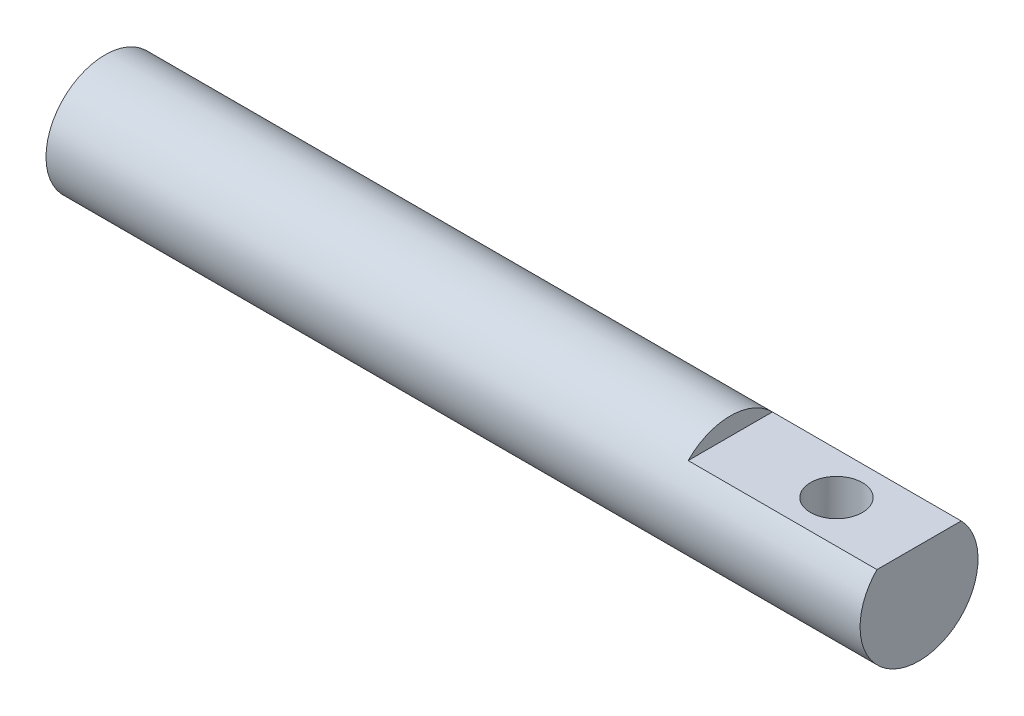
ISO-10303-21;
HEADER;
FILE_DESCRIPTION(('STEP AP214'),'2;1');
FILE_NAME('part.step','',(''),(''),'','','');
FILE_SCHEMA(('AUTOMOTIVE_DESIGN { 1 0 10303 214 1 1 1 1 }'));
ENDSEC;
DATA;
#1=APPLICATION_CONTEXT('core data for automotive mechanical design processes');
#2=APPLICATION_PROTOCOL_DEFINITION('international standard','automotive_design',2000,#1);
#3=PRODUCT_CONTEXT('',#1,'mechanical');
#4=PRODUCT('Part','Part','',(#3));
#5=PRODUCT_RELATED_PRODUCT_CATEGORY('part','',(#4));
#6=PRODUCT_DEFINITION_FORMATION('','',#4);
#7=PRODUCT_DEFINITION_CONTEXT('part definition',#1,'design');
#8=PRODUCT_DEFINITION('design','',#6,#7);
#9=PRODUCT_DEFINITION_SHAPE('','',#8);
#10=(LENGTH_UNIT() NAMED_UNIT(*) SI_UNIT(.MILLI.,.METRE.));
#11=(NAMED_UNIT(*) PLANE_ANGLE_UNIT() SI_UNIT($,.RADIAN.));
#12=(NAMED_UNIT(*) SI_UNIT($,.STERADIAN.) SOLID_ANGLE_UNIT());
#13=UNCERTAINTY_MEASURE_WITH_UNIT(LENGTH_MEASURE(1.E-05),#10,'distance_accuracy_value','');
#14=(GEOMETRIC_REPRESENTATION_CONTEXT(3) GLOBAL_UNCERTAINTY_ASSIGNED_CONTEXT((#13)) GLOBAL_UNIT_ASSIGNED_CONTEXT((#10,
#11,#12)) REPRESENTATION_CONTEXT('',''));
#15=CARTESIAN_POINT('',(0.,0.,0.));
#16=DIRECTION('',(0.,0.,1.));
#17=DIRECTION('',(1.,0.,0.));
#18=AXIS2_PLACEMENT_3D('',#15,#16,#17);
#19=CARTESIAN_POINT('',(-90.4663961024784,0.,0.));
#20=DIRECTION('',(-1.,0.,0.));
#21=DIRECTION('',(0.,0.,1.));
#22=AXIS2_PLACEMENT_3D('',#19,#20,#21);
#23=CYLINDRICAL_SURFACE('',#22,10.);
#24=CARTESIAN_POINT('',(50.6,-10.,0.));
#25=CARTESIAN_POINT('',(50.6000008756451,-9.99999927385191,0.117311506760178));
#26=CARTESIAN_POINT('',(50.6046977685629,-9.99793022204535,0.234654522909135));
#27=CARTESIAN_POINT('',(50.6234394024,-9.98970539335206,0.468497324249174));
#28=CARTESIAN_POINT('',(50.637489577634,-9.98354724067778,0.584996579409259));
#29=CARTESIAN_POINT('',(50.6748222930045,-9.96729046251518,0.81645802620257));
#30=CARTESIAN_POINT('',(50.6981223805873,-9.95718434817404,0.931416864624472));
#31=CARTESIAN_POINT('',(50.7537179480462,-9.93329160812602,1.15879035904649));
#32=CARTESIAN_POINT('',(50.7860171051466,-9.91950347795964,1.27120395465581));
#33=CARTESIAN_POINT('',(50.8591464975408,-9.88865875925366,1.49225565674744));
#34=CARTESIAN_POINT('',(50.8999422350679,-9.87161541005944,1.60090701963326));
#35=CARTESIAN_POINT('',(50.9897759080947,-9.83464430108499,1.8142545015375));
#36=CARTESIAN_POINT('',(51.0388169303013,-9.81471546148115,1.91894912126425));
#37=CARTESIAN_POINT('',(51.1976622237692,-9.75132267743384,2.22603764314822));
#38=CARTESIAN_POINT('',(51.3192827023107,-9.70421135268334,2.42171774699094));
#39=CARTESIAN_POINT('',(51.5974009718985,-9.60209161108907,2.80004131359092));
#40=CARTESIAN_POINT('',(51.7553387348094,-9.54680609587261,2.98154351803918));
#41=CARTESIAN_POINT('',(52.098552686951,-9.43567663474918,3.31649978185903));
#42=CARTESIAN_POINT('',(52.2838447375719,-9.37983238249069,3.46993745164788));
#43=CARTESIAN_POINT('',(52.6893089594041,-9.2703443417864,3.75301100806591));
#44=CARTESIAN_POINT('',(52.9108577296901,-9.21700154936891,3.88082001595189));
#45=CARTESIAN_POINT('',(53.2586528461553,-9.14654704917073,4.0427880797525));
#46=CARTESIAN_POINT('',(53.377210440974,-9.12464909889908,4.09183262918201));
#47=CARTESIAN_POINT('',(53.6187263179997,-9.08480986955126,4.17953993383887));
#48=CARTESIAN_POINT('',(53.7416822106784,-9.06686647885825,4.21820823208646));
#49=CARTESIAN_POINT('',(53.9846428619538,-9.03643592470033,4.2829943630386));
#50=CARTESIAN_POINT('',(54.1044739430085,-9.02371552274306,4.3096555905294));
#51=CARTESIAN_POINT('',(54.3462898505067,-9.00293510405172,4.35289987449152));
#52=CARTESIAN_POINT('',(54.4682736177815,-8.99487285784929,4.36948775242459));
#53=CARTESIAN_POINT('',(54.7133888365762,-8.98371652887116,4.39237983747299));
#54=CARTESIAN_POINT('',(54.8365198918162,-8.98062079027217,4.39868747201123));
#55=CARTESIAN_POINT('',(55.0828942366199,-8.97951545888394,4.40094353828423));
#56=CARTESIAN_POINT('',(55.2061375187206,-8.98150554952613,4.39689261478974));
#57=CARTESIAN_POINT('',(55.4408972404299,-8.99009811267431,4.37929465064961));
#58=CARTESIAN_POINT('',(55.5524945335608,-8.99628092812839,4.36661125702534));
#59=CARTESIAN_POINT('',(55.7741233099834,-9.01260340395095,4.33281890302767));
#60=CARTESIAN_POINT('',(55.8841542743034,-9.02274434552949,4.31170721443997));
#61=CARTESIAN_POINT('',(56.210732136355,-9.05865643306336,4.23603022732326));
#62=CARTESIAN_POINT('',(56.4239507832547,-9.08992447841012,4.16910861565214));
#63=CARTESIAN_POINT('',(56.840639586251,-9.16432218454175,4.0029461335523));
#64=CARTESIAN_POINT('',(57.0437865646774,-9.20770067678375,3.90301819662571));
#65=CARTESIAN_POINT('',(57.4313077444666,-9.30139084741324,3.67415350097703));
#66=CARTESIAN_POINT('',(57.6156740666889,-9.35170541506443,3.54520463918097));
#67=CARTESIAN_POINT('',(57.9788507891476,-9.45942031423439,3.24756701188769));
#68=CARTESIAN_POINT('',(58.155458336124,-9.51703902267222,3.07626255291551));
#69=CARTESIAN_POINT('',(58.4782288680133,-9.62886931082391,2.70596833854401));
#70=CARTESIAN_POINT('',(58.6243830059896,-9.68307989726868,2.50697056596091));
#71=CARTESIAN_POINT('',(58.8858452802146,-9.78390538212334,2.0795878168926));
#72=CARTESIAN_POINT('',(59.00015854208,-9.83026057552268,1.85052830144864));
#73=CARTESIAN_POINT('',(59.1878374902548,-9.90811015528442,1.37386638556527));
#74=CARTESIAN_POINT('',(59.2612284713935,-9.93961371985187,1.12627554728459));
#75=CARTESIAN_POINT('',(59.3601414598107,-9.98243454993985,0.637893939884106));
#76=CARTESIAN_POINT('',(59.3886124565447,-9.99499276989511,0.397809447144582));
#77=CARTESIAN_POINT('',(59.4057912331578,-10.0025454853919,-0.0840200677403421));
#78=CARTESIAN_POINT('',(59.3945121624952,-9.99754578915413,-0.325764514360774));
#79=CARTESIAN_POINT('',(59.3345302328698,-9.97133433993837,-0.789582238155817));
#80=CARTESIAN_POINT('',(59.287985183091,-9.95105771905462,-1.01199376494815));
#81=CARTESIAN_POINT('',(59.1618938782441,-9.89737940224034,-1.44555457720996));
#82=CARTESIAN_POINT('',(59.0823435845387,-9.86397610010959,-1.65670248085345));
#83=CARTESIAN_POINT('',(58.8899534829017,-9.78589702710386,-2.06922424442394));
#84=CARTESIAN_POINT('',(58.7761514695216,-9.74090174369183,-2.27008679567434));
#85=CARTESIAN_POINT('',(58.5195261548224,-9.64432232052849,-2.65059283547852));
#86=CARTESIAN_POINT('',(58.3766902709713,-9.59273532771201,-2.83022707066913));
#87=CARTESIAN_POINT('',(58.052918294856,-9.48342069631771,-3.17813921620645));
#88=CARTESIAN_POINT('',(57.8698615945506,-9.42553017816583,-3.34439341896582));
#89=CARTESIAN_POINT('',(57.4775515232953,-9.31359539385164,-3.64453875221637));
#90=CARTESIAN_POINT('',(57.2682894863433,-9.25955240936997,-3.77841913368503));
#91=CARTESIAN_POINT('',(56.9360956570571,-9.18566329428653,-3.95319006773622));
#92=CARTESIAN_POINT('',(56.8209206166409,-9.1620072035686,-4.00756040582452));
#93=CARTESIAN_POINT('',(56.5857379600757,-9.11818214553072,-4.10629671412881));
#94=CARTESIAN_POINT('',(56.4657325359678,-9.09801161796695,-4.15066716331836));
#95=CARTESIAN_POINT('',(56.2218000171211,-9.06191214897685,-4.22890136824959));
#96=CARTESIAN_POINT('',(56.0978751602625,-9.04598083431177,-4.26277100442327));
#97=CARTESIAN_POINT('',(55.8470318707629,-9.01897594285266,-4.31961424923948));
#98=CARTESIAN_POINT('',(55.7201137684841,-9.00790183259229,-4.34258905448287));
#99=CARTESIAN_POINT('',(55.4751262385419,-8.9917783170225,-4.37586938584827));
#100=CARTESIAN_POINT('',(55.3572064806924,-8.98630183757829,-4.38707519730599));
#101=CARTESIAN_POINT('',(55.1206788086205,-8.98001037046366,-4.39993940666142));
#102=CARTESIAN_POINT('',(55.0020706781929,-8.97919693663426,-4.4015946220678));
#103=CARTESIAN_POINT('',(54.7652381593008,-8.98226584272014,-4.39532840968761));
#104=CARTESIAN_POINT('',(54.647013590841,-8.98614551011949,-4.38741243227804));
#105=CARTESIAN_POINT('',(54.4117796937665,-8.99845540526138,-4.36210926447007));
#106=CARTESIAN_POINT('',(54.2947708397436,-9.00688734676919,-4.34471850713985));
#107=CARTESIAN_POINT('',(54.0696681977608,-9.02738597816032,-4.30195645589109));
#108=CARTESIAN_POINT('',(53.9614524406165,-9.03921202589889,-4.27710970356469));
#109=CARTESIAN_POINT('',(53.7475872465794,-9.06627054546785,-4.21944847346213));
#110=CARTESIAN_POINT('',(53.6419386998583,-9.08150418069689,-4.18663127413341));
#111=CARTESIAN_POINT('',(53.3298173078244,-9.13167379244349,-4.07665014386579));
#112=CARTESIAN_POINT('',(53.1280136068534,-9.17109357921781,-3.98792681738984));
#113=CARTESIAN_POINT('',(52.7289793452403,-9.26051910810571,-3.77581548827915));
#114=CARTESIAN_POINT('',(52.5328538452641,-9.31103828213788,-3.65058330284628));
#115=CARTESIAN_POINT('',(52.1632677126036,-9.41571067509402,-3.37144443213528));
#116=CARTESIAN_POINT('',(51.9898163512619,-9.46986536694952,-3.21752607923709));
#117=CARTESIAN_POINT('',(51.6552293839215,-9.58125720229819,-2.86974961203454));
#118=CARTESIAN_POINT('',(51.4963947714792,-9.63836494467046,-2.67360835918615));
#119=CARTESIAN_POINT('',(51.284481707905,-9.7180661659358,-2.36027605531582));
#120=CARTESIAN_POINT('',(51.2181903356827,-9.7436583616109,-2.2525490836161));
#121=CARTESIAN_POINT('',(51.0949179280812,-9.79216270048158,-2.03133880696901));
#122=CARTESIAN_POINT('',(51.0379325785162,-9.81507608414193,-1.91785820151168));
#123=CARTESIAN_POINT('',(50.9344110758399,-9.85732250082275,-1.68724036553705));
#124=CARTESIAN_POINT('',(50.8877598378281,-9.87669449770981,-1.57016188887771));
#125=CARTESIAN_POINT('',(50.8045554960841,-9.91162590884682,-1.33197103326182));
#126=CARTESIAN_POINT('',(50.7679975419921,-9.92718715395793,-1.21086062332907));
#127=CARTESIAN_POINT('',(50.7054454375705,-9.95401438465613,-0.965794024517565));
#128=CARTESIAN_POINT('',(50.6794258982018,-9.96529068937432,-0.841845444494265));
#129=CARTESIAN_POINT('',(50.6381569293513,-9.98325231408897,-0.591902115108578));
#130=CARTESIAN_POINT('',(50.6228999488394,-9.98994085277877,-0.465908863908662));
#131=CARTESIAN_POINT('',(50.6087453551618,-9.99615456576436,-0.283006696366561));
#132=CARTESIAN_POINT('',(50.6054670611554,-9.99759551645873,-0.226467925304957));
#133=CARTESIAN_POINT('',(50.6010941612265,-9.99951841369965,-0.113288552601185));
#134=CARTESIAN_POINT('',(50.5999995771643,-10.0000003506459,-0.0566479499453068));
#135=CARTESIAN_POINT('',(50.6,-10.,0.));
#136=B_SPLINE_CURVE_WITH_KNOTS('',3,(#24,#25,#26,#27,#28,#29,#30,#31,#32,#33,#34,#35,#36,#37,
#38,#39,#40,#41,#42,#43,#44,#45,#46,#47,#48,#49,#50,#51,#52,#53,#54,#55,#56,#57,#58,#59,#60,#61,
#62,#63,#64,#65,#66,#67,#68,#69,#70,#71,#72,#73,#74,#75,#76,#77,#78,#79,#80,#81,#82,#83,#84,#85,
#86,#87,#88,#89,#90,#91,#92,#93,#94,#95,#96,#97,#98,#99,#100,#101,#102,#103,#104,#105,#106,#107,
#108,#109,#110,#111,#112,#113,#114,#115,#116,#117,#118,#119,#120,#121,#122,#123,#124,#125,#126,
#127,#128,#129,#130,#131,#132,#133,#134,#135),.UNSPECIFIED.,.T.,.F.,(4,2,2,2,2,2,2,2,2,2,2,2,2,
2,2,2,2,2,2,2,2,2,2,2,2,2,2,2,2,2,2,2,2,2,2,2,2,2,2,2,2,2,2,2,2,2,2,2,2,2,2,2,2,2,2,4),(0.,
0.351877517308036,0.703959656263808,1.05671292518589,1.40961054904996,1.76110233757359,
2.11272600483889,2.81508489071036,3.55256658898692,4.29047760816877,5.06994179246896,
5.45996567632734,5.84978079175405,6.21953845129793,6.58911899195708,6.95857628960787,
7.32801059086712,7.66505706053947,8.00221271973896,8.67596853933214,9.36474053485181,
10.0538003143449,10.8085095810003,11.5634377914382,12.3398245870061,13.1157309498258,
13.8381934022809,14.5604168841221,15.2416973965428,15.9230612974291,16.6257080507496,
17.3286599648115,18.0872416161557,18.8460747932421,19.2342667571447,19.6222845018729,
20.0100845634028,20.3978420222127,20.7531080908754,21.1084925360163,21.4636747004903,
21.8189906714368,22.1535857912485,22.4882953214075,23.1572438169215,23.8686914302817,
24.5804290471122,25.3526808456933,25.7394411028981,26.1260215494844,26.5080522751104,
26.8898990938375,27.270820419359,27.6514742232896,27.8213888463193,27.9913051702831),.UNSPECIFIED.);
#137=CARTESIAN_POINT('',(50.6,-10.,0.));
#138=VERTEX_POINT('',#137);
#139=EDGE_CURVE('E156',#138,#138,#136,.T.);
#140=ORIENTED_EDGE('',*,*,#139,.T.);
#141=EDGE_LOOP('',(#140));
#142=FACE_BOUND('',#141,.T.);
#143=CARTESIAN_POINT('',(69.,0.,0.));
#144=DIRECTION('',(-1.,0.,0.));
#145=DIRECTION('',(0.,0.,1.));
#146=AXIS2_PLACEMENT_3D('',#143,#144,#145);
#147=CIRCLE('',#146,10.);
#148=CARTESIAN_POINT('',(69.,7.,-7.14142842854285));
#149=VERTEX_POINT('',#148);
#150=CARTESIAN_POINT('',(69.,7.,7.14142842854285));
#151=VERTEX_POINT('',#150);
#152=EDGE_CURVE('E141',#149,#151,#147,.T.);
#153=ORIENTED_EDGE('',*,*,#152,.T.);
#154=DIRECTION('',(1.,0.,0.));
#155=VECTOR('',#154,1.);
#156=CARTESIAN_POINT('',(37.,7.,7.14142842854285));
#157=LINE('',#156,#155);
#158=CARTESIAN_POINT('',(37.,7.,7.14142842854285));
#159=VERTEX_POINT('',#158);
#160=EDGE_CURVE('E132',#159,#151,#157,.T.);
#161=ORIENTED_EDGE('',*,*,#160,.F.);
#162=CARTESIAN_POINT('',(37.,0.,0.));
#163=DIRECTION('',(1.,0.,0.));
#164=DIRECTION('',(0.,0.,1.));
#165=AXIS2_PLACEMENT_3D('',#162,#163,#164);
#166=CIRCLE('',#165,10.);
#167=CARTESIAN_POINT('',(37.,7.,-7.14142842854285));
#168=VERTEX_POINT('',#167);
#169=EDGE_CURVE('E129',#168,#159,#166,.T.);
#170=ORIENTED_EDGE('',*,*,#169,.F.);
#171=DIRECTION('',(1.,0.,0.));
#172=VECTOR('',#171,1.);
#173=CARTESIAN_POINT('',(37.,7.,-7.14142842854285));
#174=LINE('',#173,#172);
#175=EDGE_CURVE('E134',#168,#149,#174,.T.);
#176=ORIENTED_EDGE('',*,*,#175,.T.);
#177=EDGE_LOOP('',(#153,#161,#170,#176));
#178=FACE_BOUND('',#177,.T.);
#179=CARTESIAN_POINT('',(-69.,0.,0.));
#180=DIRECTION('',(-1.,0.,0.));
#181=DIRECTION('',(0.,0.,1.));
#182=AXIS2_PLACEMENT_3D('',#179,#180,#181);
#183=CIRCLE('',#182,10.);
#184=CARTESIAN_POINT('',(-69.,0.,10.));
#185=VERTEX_POINT('',#184);
#186=EDGE_CURVE('E137',#185,#185,#183,.T.);
#187=ORIENTED_EDGE('',*,*,#186,.F.);
#188=EDGE_LOOP('',(#187));
#189=FACE_BOUND('',#188,.T.);
#190=CARTESIAN_POINT('',(4.,-9.16515138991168,-4.));
#191=CARTESIAN_POINT('',(4.10761170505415,-9.16512928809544,-4.00001596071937));
#192=CARTESIAN_POINT('',(4.2152113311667,-9.16704612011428,-3.99565782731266));
#193=CARTESIAN_POINT('',(4.42954259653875,-9.17459250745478,-3.9783181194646));
#194=CARTESIAN_POINT('',(4.5362745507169,-9.18022064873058,-3.96533982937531));
#195=CARTESIAN_POINT('',(4.74769364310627,-9.19499565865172,-3.93095207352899));
#196=CARTESIAN_POINT('',(4.85238716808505,-9.20412861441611,-3.90957593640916));
#197=CARTESIAN_POINT('',(5.05940154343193,-9.22560106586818,-3.85863260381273));
#198=CARTESIAN_POINT('',(5.16172224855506,-9.23794075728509,-3.82906490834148));
#199=CARTESIAN_POINT('',(5.46387170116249,-9.2791858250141,-3.72853943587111));
#200=CARTESIAN_POINT('',(5.65930846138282,-9.3123489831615,-3.64568978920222));
#201=CARTESIAN_POINT('',(6.03359116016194,-9.3862474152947,-3.45096383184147));
#202=CARTESIAN_POINT('',(6.21242110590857,-9.42698987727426,-3.33905992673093));
#203=CARTESIAN_POINT('',(6.55852479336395,-9.51401998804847,-3.08263671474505));
#204=CARTESIAN_POINT('',(6.7247344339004,-9.56048491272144,-2.936738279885));
#205=CARTESIAN_POINT('',(7.03108054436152,-9.652255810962,-2.61939292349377));
#206=CARTESIAN_POINT('',(7.17121166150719,-9.69756154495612,-2.44794076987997));
#207=CARTESIAN_POINT('',(7.42681278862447,-9.78406834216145,-2.07601181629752));
#208=CARTESIAN_POINT('',(7.54108961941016,-9.82503649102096,-1.87465586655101));
#209=CARTESIAN_POINT('',(7.73368814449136,-9.89607888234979,-1.45364828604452));
#210=CARTESIAN_POINT('',(7.81202484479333,-9.92615767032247,-1.2340043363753));
#211=CARTESIAN_POINT('',(7.92668240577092,-9.97076629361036,-0.793934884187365));
#212=CARTESIAN_POINT('',(7.96485391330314,-9.98597845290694,-0.574062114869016));
#213=CARTESIAN_POINT('',(8.00405694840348,-10.001606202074,-0.130536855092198));
#214=CARTESIAN_POINT('',(8.00510163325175,-10.0020270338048,0.0931142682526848));
#215=CARTESIAN_POINT('',(7.97103436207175,-9.98843920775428,0.524466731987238));
#216=CARTESIAN_POINT('',(7.93795005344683,-9.97523973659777,0.732358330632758));
#217=CARTESIAN_POINT('',(7.84001299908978,-9.93698538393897,1.13934964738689));
#218=CARTESIAN_POINT('',(7.77515845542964,-9.91192983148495,1.33844886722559));
#219=CARTESIAN_POINT('',(7.61472796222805,-9.85193670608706,1.72579479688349));
#220=CARTESIAN_POINT('',(7.51870360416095,-9.81685584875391,1.91383264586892));
#221=CARTESIAN_POINT('',(7.2990687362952,-9.74029168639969,2.27161599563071));
#222=CARTESIAN_POINT('',(7.17544854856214,-9.69880613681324,2.4413550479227));
#223=CARTESIAN_POINT('',(6.89471994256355,-9.61043706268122,2.76952257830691));
#224=CARTESIAN_POINT('',(6.73594698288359,-9.56337795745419,2.92647922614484));
#225=CARTESIAN_POINT('',(6.3940078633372,-9.47123359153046,3.2122147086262));
#226=CARTESIAN_POINT('',(6.21083065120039,-9.42614923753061,3.34098070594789));
#227=CARTESIAN_POINT('',(5.91836435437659,-9.36326134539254,3.51186134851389));
#228=CARTESIAN_POINT('',(5.81632816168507,-9.34283170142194,3.56571263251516));
#229=CARTESIAN_POINT('',(5.60760769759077,-9.30450957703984,3.6645476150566));
#230=CARTESIAN_POINT('',(5.50092545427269,-9.28661600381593,3.70953513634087));
#231=CARTESIAN_POINT('',(5.28377106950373,-9.25400250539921,3.79016254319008));
#232=CARTESIAN_POINT('',(5.17330382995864,-9.2392786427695,3.82581403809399));
#233=CARTESIAN_POINT('',(4.94933163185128,-9.2135146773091,3.88744848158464));
#234=CARTESIAN_POINT('',(4.83582805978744,-9.20247292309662,3.91343576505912));
#235=CARTESIAN_POINT('',(4.60255455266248,-9.18417798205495,3.95619393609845));
#236=CARTESIAN_POINT('',(4.48270580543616,-9.17707470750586,3.9726012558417));
#237=CARTESIAN_POINT('',(4.24190907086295,-9.16754485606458,3.99451448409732));
#238=CARTESIAN_POINT('',(4.12096180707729,-9.16511539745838,4.0000271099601));
#239=CARTESIAN_POINT('',(4.,-9.16515138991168,4.));
#240=B_SPLINE_CURVE_WITH_KNOTS('',3,(#190,#191,#192,#193,#194,#195,#196,#197,#198,#199,#200,
#201,#202,#203,#204,#205,#206,#207,#208,#209,#210,#211,#212,#213,#214,#215,#216,#217,#218,#219,
#220,#221,#222,#223,#224,#225,#226,#227,#228,#229,#230,#231,#232,#233,#234,#235,#236,#237,#238,
#239),.UNSPECIFIED.,.F.,.F.,(4,2,2,2,2,2,2,2,2,2,2,2,2,2,2,2,2,2,2,2,2,2,2,2,4),(0.,
0.322709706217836,0.645296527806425,0.966615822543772,1.28795473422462,1.9293660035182,
2.57138869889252,3.24636095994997,3.92147161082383,4.62325717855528,5.32474946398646,
5.99227753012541,6.65956903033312,7.28937830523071,7.91922322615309,8.55856353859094,
9.19812842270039,9.87963749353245,10.5614562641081,10.9125878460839,11.2635676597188,
11.614108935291,11.964492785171,12.3274303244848,12.6901440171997),.UNSPECIFIED.);
#241=CARTESIAN_POINT('',(4.,-9.16515138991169,-4.));
#242=VERTEX_POINT('',#241);
#243=CARTESIAN_POINT('',(4.,-9.16515138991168,4.));
#244=VERTEX_POINT('',#243);
#245=EDGE_CURVE('E164',#242,#244,#240,.T.);
#246=ORIENTED_EDGE('',*,*,#245,.F.);
#247=DIRECTION('',(-1.,0.,0.));
#248=VECTOR('',#247,1.);
#249=CARTESIAN_POINT('',(-90.4663961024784,-9.16515138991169,-3.99999999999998));
#250=LINE('',#249,#248);
#251=CARTESIAN_POINT('',(-4.,-9.16515138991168,-4.));
#252=VERTEX_POINT('',#251);
#253=EDGE_CURVE('E11',#252,#242,#250,.F.);
#254=ORIENTED_EDGE('',*,*,#253,.F.);
#255=CARTESIAN_POINT('',(-4.,-9.16515138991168,4.));
#256=CARTESIAN_POINT('',(-4.10761170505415,-9.16512928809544,4.00001596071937));
#257=CARTESIAN_POINT('',(-4.2152113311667,-9.16704612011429,3.99565782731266));
#258=CARTESIAN_POINT('',(-4.42954259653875,-9.17459250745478,3.9783181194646));
#259=CARTESIAN_POINT('',(-4.5362745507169,-9.18022064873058,3.96533982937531));
#260=CARTESIAN_POINT('',(-4.74769364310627,-9.19499565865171,3.93095207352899));
#261=CARTESIAN_POINT('',(-4.85238716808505,-9.20412861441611,3.90957593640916));
#262=CARTESIAN_POINT('',(-5.05940154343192,-9.22560106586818,3.85863260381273));
#263=CARTESIAN_POINT('',(-5.16172224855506,-9.23794075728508,3.82906490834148));
#264=CARTESIAN_POINT('',(-5.46387170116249,-9.2791858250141,3.72853943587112));
#265=CARTESIAN_POINT('',(-5.65930846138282,-9.3123489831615,3.64568978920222));
#266=CARTESIAN_POINT('',(-6.03359116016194,-9.3862474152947,3.45096383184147));
#267=CARTESIAN_POINT('',(-6.21242110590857,-9.42698987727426,3.33905992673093));
#268=CARTESIAN_POINT('',(-6.55852479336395,-9.51401998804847,3.08263671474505));
#269=CARTESIAN_POINT('',(-6.7247344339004,-9.56048491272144,2.936738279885));
#270=CARTESIAN_POINT('',(-7.03108054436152,-9.652255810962,2.61939292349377));
#271=CARTESIAN_POINT('',(-7.17121166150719,-9.69756154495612,2.44794076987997));
#272=CARTESIAN_POINT('',(-7.42681278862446,-9.78406834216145,2.07601181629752));
#273=CARTESIAN_POINT('',(-7.54108961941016,-9.82503649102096,1.87465586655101));
#274=CARTESIAN_POINT('',(-7.73368814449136,-9.89607888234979,1.45364828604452));
#275=CARTESIAN_POINT('',(-7.81202484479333,-9.92615767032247,1.2340043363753));
#276=CARTESIAN_POINT('',(-7.92668240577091,-9.97076629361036,0.793934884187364));
#277=CARTESIAN_POINT('',(-7.96485391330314,-9.98597845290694,0.574062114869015));
#278=CARTESIAN_POINT('',(-8.00405694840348,-10.001606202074,0.130536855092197));
#279=CARTESIAN_POINT('',(-8.00510163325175,-10.0020270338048,-0.0931142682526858));
#280=CARTESIAN_POINT('',(-7.97103436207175,-9.98843920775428,-0.524466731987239));
#281=CARTESIAN_POINT('',(-7.93795005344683,-9.97523973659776,-0.732358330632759));
#282=CARTESIAN_POINT('',(-7.84001299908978,-9.93698538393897,-1.13934964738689));
#283=CARTESIAN_POINT('',(-7.77515845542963,-9.91192983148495,-1.33844886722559));
#284=CARTESIAN_POINT('',(-7.61472796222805,-9.85193670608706,-1.72579479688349));
#285=CARTESIAN_POINT('',(-7.51870360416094,-9.81685584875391,-1.91383264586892));
#286=CARTESIAN_POINT('',(-7.2990687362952,-9.74029168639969,-2.27161599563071));
#287=CARTESIAN_POINT('',(-7.17544854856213,-9.69880613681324,-2.4413550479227));
#288=CARTESIAN_POINT('',(-6.89471994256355,-9.61043706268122,-2.76952257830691));
#289=CARTESIAN_POINT('',(-6.73594698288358,-9.56337795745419,-2.92647922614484));
#290=CARTESIAN_POINT('',(-6.39400786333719,-9.47123359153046,-3.2122147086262));
#291=CARTESIAN_POINT('',(-6.21083065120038,-9.42614923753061,-3.34098070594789));
#292=CARTESIAN_POINT('',(-5.91836435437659,-9.36326134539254,-3.51186134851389));
#293=CARTESIAN_POINT('',(-5.81632816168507,-9.34283170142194,-3.56571263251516));
#294=CARTESIAN_POINT('',(-5.60760769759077,-9.30450957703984,-3.6645476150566));
#295=CARTESIAN_POINT('',(-5.50092545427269,-9.28661600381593,-3.70953513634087));
#296=CARTESIAN_POINT('',(-5.28377106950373,-9.25400250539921,-3.79016254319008));
#297=CARTESIAN_POINT('',(-5.17330382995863,-9.2392786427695,-3.82581403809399));
#298=CARTESIAN_POINT('',(-4.94933163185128,-9.2135146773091,-3.88744848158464));
#299=CARTESIAN_POINT('',(-4.83582805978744,-9.20247292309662,-3.91343576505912));
#300=CARTESIAN_POINT('',(-4.60255455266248,-9.18417798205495,-3.95619393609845));
#301=CARTESIAN_POINT('',(-4.48270580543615,-9.17707470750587,-3.97260125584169));
#302=CARTESIAN_POINT('',(-4.24190907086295,-9.16754485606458,-3.99451448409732));
#303=CARTESIAN_POINT('',(-4.12096180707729,-9.16511539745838,-4.0000271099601));
#304=CARTESIAN_POINT('',(-4.,-9.16515138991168,-4.));
#305=B_SPLINE_CURVE_WITH_KNOTS('',3,(#255,#256,#257,#258,#259,#260,#261,#262,#263,#264,#265,
#266,#267,#268,#269,#270,#271,#272,#273,#274,#275,#276,#277,#278,#279,#280,#281,#282,#283,#284,
#285,#286,#287,#288,#289,#290,#291,#292,#293,#294,#295,#296,#297,#298,#299,#300,#301,#302,#303,
#304),.UNSPECIFIED.,.F.,.F.,(4,2,2,2,2,2,2,2,2,2,2,2,2,2,2,2,2,2,2,2,2,2,2,2,4),(0.,
0.322709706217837,0.645296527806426,0.966615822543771,1.28795473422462,1.9293660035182,
2.57138869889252,3.24636095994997,3.92147161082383,4.62325717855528,5.32474946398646,
5.99227753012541,6.65956903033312,7.28937830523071,7.91922322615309,8.55856353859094,
9.19812842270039,9.87963749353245,10.5614562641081,10.9125878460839,11.2635676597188,
11.614108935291,11.964492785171,12.3274303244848,12.6901440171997),.UNSPECIFIED.);
#306=CARTESIAN_POINT('',(-4.,-9.16515138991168,4.));
#307=VERTEX_POINT('',#306);
#308=EDGE_CURVE('E46',#307,#252,#305,.T.);
#309=ORIENTED_EDGE('',*,*,#308,.F.);
#310=DIRECTION('',(-1.,0.,0.));
#311=VECTOR('',#310,1.);
#312=CARTESIAN_POINT('',(-90.4663961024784,-9.16515138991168,4.));
#313=LINE('',#312,#311);
#314=EDGE_CURVE('E213',#244,#307,#313,.T.);
#315=ORIENTED_EDGE('',*,*,#314,.F.);
#316=EDGE_LOOP('',(#246,#254,#309,#315));
#317=FACE_BOUND('',#316,.T.);
#318=ADVANCED_FACE('F38',(#142,#178,#189,#317),#23,.T.);
#319=CARTESIAN_POINT('',(-69.,10.,0.));
#320=DIRECTION('',(1.,0.,0.));
#321=DIRECTION('',(0.,0.,-1.));
#322=AXIS2_PLACEMENT_3D('',#319,#320,#321);
#323=PLANE('',#322);
#324=CARTESIAN_POINT('',(-69.,0.,0.));
#325=DIRECTION('',(-1.,0.,0.));
#326=DIRECTION('',(0.,0.,1.));
#327=AXIS2_PLACEMENT_3D('',#324,#325,#326);
#328=CIRCLE('',#327,6.);
#329=CARTESIAN_POINT('',(-69.,0.,6.));
#330=VERTEX_POINT('',#329);
#331=EDGE_CURVE('E153',#330,#330,#328,.T.);
#332=ORIENTED_EDGE('',*,*,#331,.F.);
#333=EDGE_LOOP('',(#332));
#334=FACE_BOUND('',#333,.T.);
#335=ORIENTED_EDGE('',*,*,#186,.T.);
#336=EDGE_LOOP('',(#335));
#337=FACE_BOUND('',#336,.T.);
#338=ADVANCED_FACE('F40',(#334,#337),#323,.F.);
#339=CARTESIAN_POINT('',(-90.4663961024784,0.,0.));
#340=DIRECTION('',(-1.,0.,0.));
#341=DIRECTION('',(0.,0.,1.));
#342=AXIS2_PLACEMENT_3D('',#339,#340,#341);
#343=CYLINDRICAL_SURFACE('',#342,6.);
#344=CARTESIAN_POINT('',(-55.,0.,0.));
#345=DIRECTION('',(-1.,0.,0.));
#346=DIRECTION('',(0.,0.,1.));
#347=AXIS2_PLACEMENT_3D('',#344,#345,#346);
#348=CIRCLE('',#347,6.);
#349=CARTESIAN_POINT('',(-55.,0.,6.));
#350=VERTEX_POINT('',#349);
#351=EDGE_CURVE('E150',#350,#350,#348,.T.);
#352=ORIENTED_EDGE('',*,*,#351,.F.);
#353=EDGE_LOOP('',(#352));
#354=FACE_BOUND('',#353,.T.);
#355=ORIENTED_EDGE('',*,*,#331,.T.);
#356=EDGE_LOOP('',(#355));
#357=FACE_BOUND('',#356,.T.);
#358=ADVANCED_FACE('F201',(#354,#357),#343,.F.);
#359=CARTESIAN_POINT('',(-55.,6.,0.));
#360=DIRECTION('',(-1.,0.,0.));
#361=DIRECTION('',(0.,0.,1.));
#362=AXIS2_PLACEMENT_3D('',#359,#360,#361);
#363=PLANE('',#362);
#364=CARTESIAN_POINT('',(-55.,0.,0.));
#365=DIRECTION('',(-1.,0.,0.));
#366=DIRECTION('',(0.,0.,1.));
#367=AXIS2_PLACEMENT_3D('',#364,#365,#366);
#368=CIRCLE('',#367,7.);
#369=CARTESIAN_POINT('',(-55.,0.,7.));
#370=VERTEX_POINT('',#369);
#371=EDGE_CURVE('E147',#370,#370,#368,.T.);
#372=ORIENTED_EDGE('',*,*,#371,.F.);
#373=EDGE_LOOP('',(#372));
#374=FACE_BOUND('',#373,.T.);
#375=ORIENTED_EDGE('',*,*,#351,.T.);
#376=EDGE_LOOP('',(#375));
#377=FACE_BOUND('',#376,.T.);
#378=ADVANCED_FACE('F332',(#374,#377),#363,.F.);
#379=CARTESIAN_POINT('',(-90.4663961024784,0.,0.));
#380=DIRECTION('',(-1.,0.,0.));
#381=DIRECTION('',(0.,0.,1.));
#382=AXIS2_PLACEMENT_3D('',#379,#380,#381);
#383=CYLINDRICAL_SURFACE('',#382,7.);
#384=CARTESIAN_POINT('',(-19.,0.,0.));
#385=DIRECTION('',(-1.,0.,0.));
#386=DIRECTION('',(0.,0.,1.));
#387=AXIS2_PLACEMENT_3D('',#384,#385,#386);
#388=CIRCLE('',#387,7.);
#389=CARTESIAN_POINT('',(-19.,0.,7.));
#390=VERTEX_POINT('',#389);
#391=EDGE_CURVE('E144',#390,#390,#388,.T.);
#392=ORIENTED_EDGE('',*,*,#391,.F.);
#393=EDGE_LOOP('',(#392));
#394=FACE_BOUND('',#393,.T.);
#395=ORIENTED_EDGE('',*,*,#371,.T.);
#396=EDGE_LOOP('',(#395));
#397=FACE_BOUND('',#396,.T.);
#398=ADVANCED_FACE('F322',(#394,#397),#383,.F.);
#399=CARTESIAN_POINT('',(-19.,7.,0.));
#400=DIRECTION('',(1.,0.,0.));
#401=DIRECTION('',(0.,0.,-1.));
#402=AXIS2_PLACEMENT_3D('',#399,#400,#401);
#403=PLANE('',#402);
#404=ORIENTED_EDGE('',*,*,#391,.T.);
#405=EDGE_LOOP('',(#404));
#406=FACE_BOUND('',#405,.T.);
#407=ADVANCED_FACE('F192',(#406),#403,.F.);
#408=CARTESIAN_POINT('',(69.,0.,0.));
#409=DIRECTION('',(-1.,0.,0.));
#410=DIRECTION('',(0.,0.,1.));
#411=AXIS2_PLACEMENT_3D('',#408,#409,#410);
#412=PLANE('',#411);
#413=ORIENTED_EDGE('',*,*,#152,.F.);
#414=DIRECTION('',(0.,0.,-1.));
#415=VECTOR('',#414,1.);
#416=CARTESIAN_POINT('',(69.,7.,7.14142842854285));
#417=LINE('',#416,#415);
#418=EDGE_CURVE('E128',#151,#149,#417,.T.);
#419=ORIENTED_EDGE('',*,*,#418,.F.);
#420=EDGE_LOOP('',(#413,#419));
#421=FACE_BOUND('',#420,.T.);
#422=ADVANCED_FACE('F187',(#421),#412,.F.);
#423=CARTESIAN_POINT('',(37.,7.,7.14142842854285));
#424=DIRECTION('',(0.,-1.,0.));
#425=DIRECTION('',(0.,0.,-1.));
#426=AXIS2_PLACEMENT_3D('',#423,#424,#425);
#427=PLANE('',#426);
#428=CARTESIAN_POINT('',(55.,7.,0.));
#429=DIRECTION('',(0.,1.,0.));
#430=DIRECTION('',(0.,0.,1.));
#431=AXIS2_PLACEMENT_3D('',#428,#429,#430);
#432=CIRCLE('',#431,4.39999999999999);
#433=CARTESIAN_POINT('',(55.,7.,4.39999999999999));
#434=VERTEX_POINT('',#433);
#435=EDGE_CURVE('E125',#434,#434,#432,.T.);
#436=ORIENTED_EDGE('',*,*,#435,.F.);
#437=EDGE_LOOP('',(#436));
#438=FACE_BOUND('',#437,.T.);
#439=ORIENTED_EDGE('',*,*,#418,.T.);
#440=ORIENTED_EDGE('',*,*,#175,.F.);
#441=DIRECTION('',(0.,0.,-1.));
#442=VECTOR('',#441,1.);
#443=CARTESIAN_POINT('',(37.,7.,7.14142842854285));
#444=LINE('',#443,#442);
#445=EDGE_CURVE('E59',#159,#168,#444,.T.);
#446=ORIENTED_EDGE('',*,*,#445,.F.);
#447=ORIENTED_EDGE('',*,*,#160,.T.);
#448=EDGE_LOOP('',(#439,#440,#446,#447));
#449=FACE_BOUND('',#448,.T.);
#450=ADVANCED_FACE('F185',(#438,#449),#427,.F.);
#451=CARTESIAN_POINT('',(37.,0.,0.));
#452=DIRECTION('',(-1.,0.,0.));
#453=DIRECTION('',(0.,0.,1.));
#454=AXIS2_PLACEMENT_3D('',#451,#452,#453);
#455=PLANE('',#454);
#456=ORIENTED_EDGE('',*,*,#169,.T.);
#457=ORIENTED_EDGE('',*,*,#445,.T.);
#458=EDGE_LOOP('',(#456,#457));
#459=FACE_BOUND('',#458,.T.);
#460=ADVANCED_FACE('F180',(#459),#455,.F.);
#461=CARTESIAN_POINT('',(55.,7.,0.));
#462=DIRECTION('',(0.,1.,0.));
#463=DIRECTION('',(0.,0.,1.));
#464=AXIS2_PLACEMENT_3D('',#461,#462,#463);
#465=CYLINDRICAL_SURFACE('',#464,4.39999999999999);
#466=ORIENTED_EDGE('',*,*,#435,.T.);
#467=EDGE_LOOP('',(#466));
#468=FACE_BOUND('',#467,.T.);
#469=ORIENTED_EDGE('',*,*,#139,.F.);
#470=EDGE_LOOP('',(#469));
#471=FACE_BOUND('',#470,.T.);
#472=ADVANCED_FACE('F174',(#468,#471),#465,.F.);
#473=CARTESIAN_POINT('',(-4.,-6.,0.));
#474=DIRECTION('',(0.,-1.,0.));
#475=DIRECTION('',(0.,0.,-1.));
#476=AXIS2_PLACEMENT_3D('',#473,#474,#475);
#477=CYLINDRICAL_SURFACE('',#476,4.);
#478=DIRECTION('',(0.,-1.,0.));
#479=VECTOR('',#478,1.);
#480=CARTESIAN_POINT('',(-4.,-6.,4.));
#481=LINE('',#480,#479);
#482=CARTESIAN_POINT('',(-4.,-6.,4.));
#483=VERTEX_POINT('',#482);
#484=EDGE_CURVE('E122',#483,#307,#481,.T.);
#485=ORIENTED_EDGE('',*,*,#484,.T.);
#486=ORIENTED_EDGE('',*,*,#308,.T.);
#487=DIRECTION('',(0.,-1.,0.));
#488=VECTOR('',#487,1.);
#489=CARTESIAN_POINT('',(-4.,-6.,-4.));
#490=LINE('',#489,#488);
#491=CARTESIAN_POINT('',(-4.,-6.,-4.));
#492=VERTEX_POINT('',#491);
#493=EDGE_CURVE('E52',#492,#252,#490,.T.);
#494=ORIENTED_EDGE('',*,*,#493,.F.);
#495=CARTESIAN_POINT('',(-4.,-6.,0.));
#496=DIRECTION('',(0.,1.,0.));
#497=DIRECTION('',(0.,0.,1.));
#498=AXIS2_PLACEMENT_3D('',#495,#496,#497);
#499=CIRCLE('',#498,4.);
#500=EDGE_CURVE('E104',#492,#483,#499,.T.);
#501=ORIENTED_EDGE('',*,*,#500,.T.);
#502=EDGE_LOOP('',(#485,#486,#494,#501));
#503=FACE_BOUND('',#502,.T.);
#504=ADVANCED_FACE('F179',(#503),#477,.F.);
#505=CARTESIAN_POINT('',(-4.,-6.,4.));
#506=DIRECTION('',(0.,0.,-1.));
#507=DIRECTION('',(-1.,0.,0.));
#508=AXIS2_PLACEMENT_3D('',#505,#506,#507);
#509=PLANE('',#508);
#510=ORIENTED_EDGE('',*,*,#314,.T.);
#511=ORIENTED_EDGE('',*,*,#484,.F.);
#512=DIRECTION('',(1.,0.,0.));
#513=VECTOR('',#512,1.);
#514=CARTESIAN_POINT('',(-4.,-6.,4.));
#515=LINE('',#514,#513);
#516=CARTESIAN_POINT('',(4.,-6.,4.));
#517=VERTEX_POINT('',#516);
#518=EDGE_CURVE('E109',#483,#517,#515,.T.);
#519=ORIENTED_EDGE('',*,*,#518,.T.);
#520=DIRECTION('',(0.,-1.,0.));
#521=VECTOR('',#520,1.);
#522=CARTESIAN_POINT('',(4.,-6.,4.));
#523=LINE('',#522,#521);
#524=EDGE_CURVE('E119',#517,#244,#523,.T.);
#525=ORIENTED_EDGE('',*,*,#524,.T.);
#526=EDGE_LOOP('',(#510,#511,#519,#525));
#527=FACE_BOUND('',#526,.T.);
#528=ADVANCED_FACE('F231',(#527),#509,.T.);
#529=CARTESIAN_POINT('',(4.,-6.,0.));
#530=DIRECTION('',(0.,-1.,0.));
#531=DIRECTION('',(0.,0.,-1.));
#532=AXIS2_PLACEMENT_3D('',#529,#530,#531);
#533=CYLINDRICAL_SURFACE('',#532,4.);
#534=DIRECTION('',(0.,-1.,0.));
#535=VECTOR('',#534,1.);
#536=CARTESIAN_POINT('',(4.,-6.,-4.));
#537=LINE('',#536,#535);
#538=CARTESIAN_POINT('',(4.,-6.,-4.));
#539=VERTEX_POINT('',#538);
#540=EDGE_CURVE('E116',#539,#242,#537,.T.);
#541=ORIENTED_EDGE('',*,*,#540,.T.);
#542=ORIENTED_EDGE('',*,*,#245,.T.);
#543=ORIENTED_EDGE('',*,*,#524,.F.);
#544=CARTESIAN_POINT('',(4.,-6.,0.));
#545=DIRECTION('',(0.,1.,0.));
#546=DIRECTION('',(0.,0.,1.));
#547=AXIS2_PLACEMENT_3D('',#544,#545,#546);
#548=CIRCLE('',#547,4.);
#549=EDGE_CURVE('E111',#517,#539,#548,.T.);
#550=ORIENTED_EDGE('',*,*,#549,.T.);
#551=EDGE_LOOP('',(#541,#542,#543,#550));
#552=FACE_BOUND('',#551,.T.);
#553=ADVANCED_FACE('F219',(#552),#533,.F.);
#554=CARTESIAN_POINT('',(-4.,-6.,-4.));
#555=DIRECTION('',(0.,0.,1.));
#556=DIRECTION('',(1.,0.,0.));
#557=AXIS2_PLACEMENT_3D('',#554,#555,#556);
#558=PLANE('',#557);
#559=ORIENTED_EDGE('',*,*,#253,.T.);
#560=ORIENTED_EDGE('',*,*,#540,.F.);
#561=DIRECTION('',(-1.,0.,0.));
#562=VECTOR('',#561,1.);
#563=CARTESIAN_POINT('',(-4.,-6.,-4.));
#564=LINE('',#563,#562);
#565=EDGE_CURVE('E113',#539,#492,#564,.T.);
#566=ORIENTED_EDGE('',*,*,#565,.T.);
#567=ORIENTED_EDGE('',*,*,#493,.T.);
#568=EDGE_LOOP('',(#559,#560,#566,#567));
#569=FACE_BOUND('',#568,.T.);
#570=ADVANCED_FACE('F217',(#569),#558,.T.);
#571=CARTESIAN_POINT('',(-4.,-6.,0.));
#572=DIRECTION('',(0.,1.,0.));
#573=DIRECTION('',(0.,0.,1.));
#574=AXIS2_PLACEMENT_3D('',#571,#572,#573);
#575=PLANE('',#574);
#576=CARTESIAN_POINT('',(0.,-6.,0.));
#577=DIRECTION('',(0.,-1.,0.));
#578=DIRECTION('',(0.,0.,-1.));
#579=AXIS2_PLACEMENT_3D('',#576,#577,#578);
#580=CIRCLE('',#579,1.25);
#581=CARTESIAN_POINT('',(0.,-6.,-1.25));
#582=VERTEX_POINT('',#581);
#583=EDGE_CURVE('E101',#582,#582,#580,.T.);
#584=ORIENTED_EDGE('',*,*,#583,.F.);
#585=EDGE_LOOP('',(#584));
#586=FACE_BOUND('',#585,.T.);
#587=ORIENTED_EDGE('',*,*,#500,.F.);
#588=ORIENTED_EDGE('',*,*,#565,.F.);
#589=ORIENTED_EDGE('',*,*,#549,.F.);
#590=ORIENTED_EDGE('',*,*,#518,.F.);
#591=EDGE_LOOP('',(#587,#588,#589,#590));
#592=FACE_BOUND('',#591,.T.);
#593=ADVANCED_FACE('F223',(#586,#592),#575,.F.);
#594=CARTESIAN_POINT('',(0.,-6.,0.));
#595=DIRECTION('',(0.,-1.,0.));
#596=DIRECTION('',(0.,0.,-1.));
#597=AXIS2_PLACEMENT_3D('',#594,#595,#596);
#598=CYLINDRICAL_SURFACE('',#597,1.25);
#599=CARTESIAN_POINT('',(0.,2.5,0.));
#600=DIRECTION('',(0.,-1.,0.));
#601=DIRECTION('',(0.,0.,-1.));
#602=AXIS2_PLACEMENT_3D('',#599,#600,#601);
#603=CIRCLE('',#602,1.25);
#604=CARTESIAN_POINT('',(0.,2.5,-1.25));
#605=VERTEX_POINT('',#604);
#606=EDGE_CURVE('E99',#605,#605,#603,.T.);
#607=ORIENTED_EDGE('',*,*,#606,.F.);
#608=EDGE_LOOP('',(#607));
#609=FACE_BOUND('',#608,.T.);
#610=ORIENTED_EDGE('',*,*,#583,.T.);
#611=EDGE_LOOP('',(#610));
#612=FACE_BOUND('',#611,.T.);
#613=ADVANCED_FACE('F95',(#609,#612),#598,.F.);
#614=CARTESIAN_POINT('',(0.,2.5,0.));
#615=DIRECTION('',(0.,-1.,0.));
#616=DIRECTION('',(0.,0.,-1.));
#617=AXIS2_PLACEMENT_3D('',#614,#615,#616);
#618=CONICAL_SURFACE('',#617,1.25,1.02974425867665);
#619=CARTESIAN_POINT('',(0.,3.25107577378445,0.));
#620=VERTEX_POINT('',#619);
#621=VERTEX_LOOP('',#620);
#622=FACE_BOUND('',#621,.T.);
#623=ORIENTED_EDGE('',*,*,#606,.T.);
#624=EDGE_LOOP('',(#623));
#625=FACE_BOUND('',#624,.T.);
#626=ADVANCED_FACE('F92',(#622,#625),#618,.F.);
#627=CLOSED_SHELL('',(#318,#338,#358,#378,#398,#407,#422,#450,#460,#472,#504,#528,#553,#570,
#593,#613,#626));
#628=MANIFOLD_SOLID_BREP('B2',#627);
#629=ADVANCED_BREP_SHAPE_REPRESENTATION('',(#18,#628),#14);
#630=SHAPE_DEFINITION_REPRESENTATION(#9,#629);
ENDSEC;
END-ISO-10303-21;
